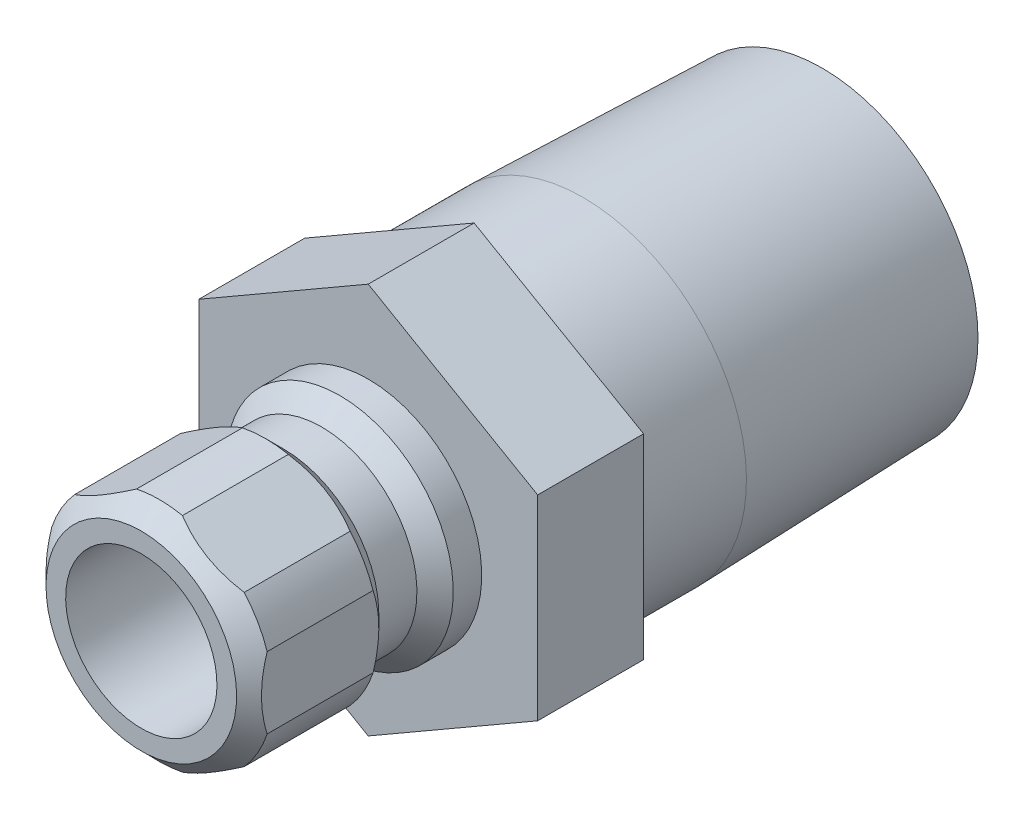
ISO-10303-21;
HEADER;
FILE_DESCRIPTION(('STEP AP214'),'2;1');
FILE_NAME('part.step','',(''),(''),'','','');
FILE_SCHEMA(('AUTOMOTIVE_DESIGN { 1 0 10303 214 1 1 1 1 }'));
ENDSEC;
DATA;
#1=APPLICATION_CONTEXT('core data for automotive mechanical design processes');
#2=APPLICATION_PROTOCOL_DEFINITION('international standard','automotive_design',2000,#1);
#3=PRODUCT_CONTEXT('',#1,'mechanical');
#4=PRODUCT('Part','Part','',(#3));
#5=PRODUCT_RELATED_PRODUCT_CATEGORY('part','',(#4));
#6=PRODUCT_DEFINITION_FORMATION('','',#4);
#7=PRODUCT_DEFINITION_CONTEXT('part definition',#1,'design');
#8=PRODUCT_DEFINITION('design','',#6,#7);
#9=PRODUCT_DEFINITION_SHAPE('','',#8);
#10=(LENGTH_UNIT() NAMED_UNIT(*) SI_UNIT(.MILLI.,.METRE.));
#11=(NAMED_UNIT(*) PLANE_ANGLE_UNIT() SI_UNIT($,.RADIAN.));
#12=(NAMED_UNIT(*) SI_UNIT($,.STERADIAN.) SOLID_ANGLE_UNIT());
#13=UNCERTAINTY_MEASURE_WITH_UNIT(LENGTH_MEASURE(1.E-05),#10,'distance_accuracy_value','');
#14=(GEOMETRIC_REPRESENTATION_CONTEXT(3) GLOBAL_UNCERTAINTY_ASSIGNED_CONTEXT((#13)) GLOBAL_UNIT_ASSIGNED_CONTEXT((#10,
#11,#12)) REPRESENTATION_CONTEXT('',''));
#15=CARTESIAN_POINT('',(0.,0.,0.));
#16=DIRECTION('',(0.,0.,1.));
#17=DIRECTION('',(1.,0.,0.));
#18=AXIS2_PLACEMENT_3D('',#15,#16,#17);
#19=CARTESIAN_POINT('',(0.,0.,0.));
#20=DIRECTION('',(0.,0.,-1.));
#21=DIRECTION('',(0.,1.,0.));
#22=AXIS2_PLACEMENT_3D('',#19,#20,#21);
#23=CYLINDRICAL_SURFACE('',#22,4.7625);
#24=DIRECTION('',(0.,0.,-1.));
#25=VECTOR('',#24,1.);
#26=CARTESIAN_POINT('',(-3.55679350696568,3.16711638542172,0.));
#27=LINE('',#26,#25);
#28=CARTESIAN_POINT('',(-3.55679350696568,3.16711638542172,4.318));
#29=VERTEX_POINT('',#28);
#30=CARTESIAN_POINT('',(-3.55679350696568,3.16711638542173,8.763));
#31=VERTEX_POINT('',#30);
#32=EDGE_CURVE('E52',#29,#31,#27,.F.);
#33=ORIENTED_EDGE('',*,*,#32,.F.);
#34=CARTESIAN_POINT('',(0.,0.,4.318));
#35=DIRECTION('',(0.,0.,-1.));
#36=DIRECTION('',(0.,1.,0.));
#37=AXIS2_PLACEMENT_3D('',#34,#35,#36);
#38=CIRCLE('',#37,4.7625);
#39=CARTESIAN_POINT('',(-4.5212,1.49671534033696,4.318));
#40=VERTEX_POINT('',#39);
#41=EDGE_CURVE('E193',#40,#29,#38,.T.);
#42=ORIENTED_EDGE('',*,*,#41,.F.);
#43=DIRECTION('',(0.,0.,-1.));
#44=VECTOR('',#43,1.);
#45=CARTESIAN_POINT('',(-4.5212,1.49671534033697,0.));
#46=LINE('',#45,#44);
#47=CARTESIAN_POINT('',(-4.5212,1.49671534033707,8.76300000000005));
#48=VERTEX_POINT('',#47);
#49=EDGE_CURVE('E386',#48,#40,#46,.T.);
#50=ORIENTED_EDGE('',*,*,#49,.F.);
#51=CARTESIAN_POINT('',(0.,0.,8.763));
#52=DIRECTION('',(0.,0.,-1.));
#53=DIRECTION('',(0.,1.,0.));
#54=AXIS2_PLACEMENT_3D('',#51,#52,#53);
#55=CIRCLE('',#54,4.7625);
#56=EDGE_CURVE('E198',#48,#31,#55,.T.);
#57=ORIENTED_EDGE('',*,*,#56,.T.);
#58=EDGE_LOOP('',(#33,#42,#50,#57));
#59=FACE_BOUND('',#58,.T.);
#60=ADVANCED_FACE('F33',(#59),#23,.T.);
#61=DIRECTION('',(0.,0.,-1.));
#62=VECTOR('',#61,1.);
#63=CARTESIAN_POINT('',(-4.5212,-1.49671534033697,0.));
#64=LINE('',#63,#62);
#65=CARTESIAN_POINT('',(-4.5212,-1.49671534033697,4.318));
#66=VERTEX_POINT('',#65);
#67=CARTESIAN_POINT('',(-4.5212,-1.49671534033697,8.763));
#68=VERTEX_POINT('',#67);
#69=EDGE_CURVE('E60',#66,#68,#64,.F.);
#70=ORIENTED_EDGE('',*,*,#69,.F.);
#71=CARTESIAN_POINT('',(-3.55679350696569,-3.16711638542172,4.318));
#72=VERTEX_POINT('',#71);
#73=EDGE_CURVE('E443',#72,#66,#38,.T.);
#74=ORIENTED_EDGE('',*,*,#73,.F.);
#75=DIRECTION('',(0.,0.,-1.));
#76=VECTOR('',#75,1.);
#77=CARTESIAN_POINT('',(-3.55679350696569,-3.16711638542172,0.));
#78=LINE('',#77,#76);
#79=CARTESIAN_POINT('',(-3.55679350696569,-3.16711638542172,8.763));
#80=VERTEX_POINT('',#79);
#81=EDGE_CURVE('E381',#80,#72,#78,.T.);
#82=ORIENTED_EDGE('',*,*,#81,.F.);
#83=EDGE_CURVE('E203',#80,#68,#55,.T.);
#84=ORIENTED_EDGE('',*,*,#83,.T.);
#85=EDGE_LOOP('',(#70,#74,#82,#84));
#86=FACE_BOUND('',#85,.T.);
#87=ADVANCED_FACE('F378',(#86),#23,.T.);
#88=DIRECTION('',(0.,0.,-1.));
#89=VECTOR('',#88,1.);
#90=CARTESIAN_POINT('',(-0.964406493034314,-4.66383172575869,0.));
#91=LINE('',#90,#89);
#92=CARTESIAN_POINT('',(-0.964406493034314,-4.66383172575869,4.318));
#93=VERTEX_POINT('',#92);
#94=CARTESIAN_POINT('',(-0.964406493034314,-4.66383172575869,8.763));
#95=VERTEX_POINT('',#94);
#96=EDGE_CURVE('E392',#93,#95,#91,.F.);
#97=ORIENTED_EDGE('',*,*,#96,.F.);
#98=CARTESIAN_POINT('',(0.96440649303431,-4.66383172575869,4.318));
#99=VERTEX_POINT('',#98);
#100=EDGE_CURVE('E441',#99,#93,#38,.T.);
#101=ORIENTED_EDGE('',*,*,#100,.F.);
#102=DIRECTION('',(0.,0.,-1.));
#103=VECTOR('',#102,1.);
#104=CARTESIAN_POINT('',(0.96440649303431,-4.66383172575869,0.));
#105=LINE('',#104,#103);
#106=CARTESIAN_POINT('',(0.96440649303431,-4.66383172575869,8.763));
#107=VERTEX_POINT('',#106);
#108=EDGE_CURVE('E427',#107,#99,#105,.T.);
#109=ORIENTED_EDGE('',*,*,#108,.F.);
#110=EDGE_CURVE('E196',#107,#95,#55,.T.);
#111=ORIENTED_EDGE('',*,*,#110,.T.);
#112=EDGE_LOOP('',(#97,#101,#109,#111));
#113=FACE_BOUND('',#112,.T.);
#114=ADVANCED_FACE('F440',(#113),#23,.T.);
#115=DIRECTION('',(0.,0.,-1.));
#116=VECTOR('',#115,1.);
#117=CARTESIAN_POINT('',(3.55679350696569,-3.16711638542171,0.));
#118=LINE('',#117,#116);
#119=CARTESIAN_POINT('',(3.55679350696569,-3.16711638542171,4.318));
#120=VERTEX_POINT('',#119);
#121=CARTESIAN_POINT('',(3.55679350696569,-3.16711638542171,8.763));
#122=VERTEX_POINT('',#121);
#123=EDGE_CURVE('E429',#120,#122,#118,.F.);
#124=ORIENTED_EDGE('',*,*,#123,.F.);
#125=CARTESIAN_POINT('',(4.5212,-1.49671534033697,4.318));
#126=VERTEX_POINT('',#125);
#127=EDGE_CURVE('E368',#126,#120,#38,.T.);
#128=ORIENTED_EDGE('',*,*,#127,.F.);
#129=DIRECTION('',(0.,0.,-1.));
#130=VECTOR('',#129,1.);
#131=CARTESIAN_POINT('',(4.5212,-1.49671534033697,0.));
#132=LINE('',#131,#130);
#133=CARTESIAN_POINT('',(4.5212,-1.4967153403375,8.76300000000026));
#134=VERTEX_POINT('',#133);
#135=EDGE_CURVE('E360',#134,#126,#132,.T.);
#136=ORIENTED_EDGE('',*,*,#135,.F.);
#137=EDGE_CURVE('E189',#134,#122,#55,.T.);
#138=ORIENTED_EDGE('',*,*,#137,.T.);
#139=EDGE_LOOP('',(#124,#128,#136,#138));
#140=FACE_BOUND('',#139,.T.);
#141=ADVANCED_FACE('F366',(#140),#23,.T.);
#142=DIRECTION('',(0.,0.,-1.));
#143=VECTOR('',#142,1.);
#144=CARTESIAN_POINT('',(4.5212,1.49671534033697,0.));
#145=LINE('',#144,#143);
#146=CARTESIAN_POINT('',(4.5212,1.49671534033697,4.318));
#147=VERTEX_POINT('',#146);
#148=CARTESIAN_POINT('',(4.5212,1.49671534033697,8.763));
#149=VERTEX_POINT('',#148);
#150=EDGE_CURVE('E362',#147,#149,#145,.F.);
#151=ORIENTED_EDGE('',*,*,#150,.F.);
#152=CARTESIAN_POINT('',(3.55679350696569,3.16711638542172,4.318));
#153=VERTEX_POINT('',#152);
#154=EDGE_CURVE('E182',#153,#147,#38,.T.);
#155=ORIENTED_EDGE('',*,*,#154,.F.);
#156=DIRECTION('',(0.,0.,-1.));
#157=VECTOR('',#156,1.);
#158=CARTESIAN_POINT('',(3.55679350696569,3.16711638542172,0.));
#159=LINE('',#158,#157);
#160=CARTESIAN_POINT('',(3.55679350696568,3.16711638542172,8.763));
#161=VERTEX_POINT('',#160);
#162=EDGE_CURVE('E164',#161,#153,#159,.T.);
#163=ORIENTED_EDGE('',*,*,#162,.F.);
#164=EDGE_CURVE('E180',#161,#149,#55,.T.);
#165=ORIENTED_EDGE('',*,*,#164,.T.);
#166=EDGE_LOOP('',(#151,#155,#163,#165));
#167=FACE_BOUND('',#166,.T.);
#168=ADVANCED_FACE('F179',(#167),#23,.T.);
#169=CARTESIAN_POINT('',(0.,0.,0.));
#170=DIRECTION('',(0.,0.,-1.));
#171=DIRECTION('',(0.,1.,0.));
#172=AXIS2_PLACEMENT_3D('',#169,#170,#171);
#173=CYLINDRICAL_SURFACE('',#172,3.175);
#174=CARTESIAN_POINT('',(0.,0.,9.525));
#175=DIRECTION('',(0.,0.,-1.));
#176=DIRECTION('',(0.,1.,0.));
#177=AXIS2_PLACEMENT_3D('',#174,#175,#176);
#178=CIRCLE('',#177,3.175);
#179=CARTESIAN_POINT('',(0.,3.175,9.525));
#180=VERTEX_POINT('',#179);
#181=EDGE_CURVE('E205',#180,#180,#178,.T.);
#182=ORIENTED_EDGE('',*,*,#181,.F.);
#183=EDGE_LOOP('',(#182));
#184=FACE_BOUND('',#183,.T.);
#185=CARTESIAN_POINT('',(0.,0.,-4.445));
#186=DIRECTION('',(0.,0.,1.));
#187=DIRECTION('',(1.,0.,0.));
#188=AXIS2_PLACEMENT_3D('',#185,#186,#187);
#189=CIRCLE('',#188,3.175);
#190=CARTESIAN_POINT('',(3.175,0.,-4.445));
#191=VERTEX_POINT('',#190);
#192=EDGE_CURVE('E246',#191,#191,#189,.T.);
#193=ORIENTED_EDGE('',*,*,#192,.F.);
#194=EDGE_LOOP('',(#193));
#195=FACE_BOUND('',#194,.T.);
#196=ADVANCED_FACE('F35',(#184,#195),#173,.F.);
#197=CARTESIAN_POINT('',(0.,4.7625,0.));
#198=DIRECTION('',(0.,0.,1.));
#199=DIRECTION('',(0.,-1.,0.));
#200=AXIS2_PLACEMENT_3D('',#197,#198,#199);
#201=PLANE('',#200);
#202=CARTESIAN_POINT('',(0.,0.,0.));
#203=DIRECTION('',(0.,0.,-1.));
#204=DIRECTION('',(0.,1.,0.));
#205=AXIS2_PLACEMENT_3D('',#202,#203,#204);
#206=CIRCLE('',#205,4.7625);
#207=CARTESIAN_POINT('',(0.,4.7625,0.));
#208=VERTEX_POINT('',#207);
#209=EDGE_CURVE('E454',#208,#208,#206,.T.);
#210=ORIENTED_EDGE('',*,*,#209,.T.);
#211=EDGE_LOOP('',(#210));
#212=FACE_BOUND('',#211,.T.);
#213=DIRECTION('',(-0.866025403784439,-0.5,0.));
#214=VECTOR('',#213,1.);
#215=CARTESIAN_POINT('',(0.,8.21223022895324,0.));
#216=LINE('',#215,#214);
#217=CARTESIAN_POINT('',(0.,8.21223022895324,0.));
#218=VERTEX_POINT('',#217);
#219=CARTESIAN_POINT('',(-7.112,4.10611511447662,0.));
#220=VERTEX_POINT('',#219);
#221=EDGE_CURVE('E243',#218,#220,#216,.T.);
#222=ORIENTED_EDGE('',*,*,#221,.T.);
#223=DIRECTION('',(0.,-1.,0.));
#224=VECTOR('',#223,1.);
#225=CARTESIAN_POINT('',(-7.112,4.10611511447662,0.));
#226=LINE('',#225,#224);
#227=CARTESIAN_POINT('',(-7.112,-4.10611511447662,0.));
#228=VERTEX_POINT('',#227);
#229=EDGE_CURVE('E240',#220,#228,#226,.T.);
#230=ORIENTED_EDGE('',*,*,#229,.T.);
#231=DIRECTION('',(0.866025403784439,-0.5,0.));
#232=VECTOR('',#231,1.);
#233=CARTESIAN_POINT('',(-7.112,-4.10611511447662,0.));
#234=LINE('',#233,#232);
#235=CARTESIAN_POINT('',(0.,-8.21223022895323,0.));
#236=VERTEX_POINT('',#235);
#237=EDGE_CURVE('E237',#228,#236,#234,.T.);
#238=ORIENTED_EDGE('',*,*,#237,.T.);
#239=DIRECTION('',(0.866025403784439,0.5,0.));
#240=VECTOR('',#239,1.);
#241=CARTESIAN_POINT('',(0.,-8.21223022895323,0.));
#242=LINE('',#241,#240);
#243=CARTESIAN_POINT('',(7.112,-4.10611511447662,0.));
#244=VERTEX_POINT('',#243);
#245=EDGE_CURVE('E234',#236,#244,#242,.T.);
#246=ORIENTED_EDGE('',*,*,#245,.T.);
#247=DIRECTION('',(0.,1.,0.));
#248=VECTOR('',#247,1.);
#249=CARTESIAN_POINT('',(7.112,-4.10611511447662,0.));
#250=LINE('',#249,#248);
#251=CARTESIAN_POINT('',(7.112,4.10611511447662,0.));
#252=VERTEX_POINT('',#251);
#253=EDGE_CURVE('E231',#244,#252,#250,.T.);
#254=ORIENTED_EDGE('',*,*,#253,.T.);
#255=DIRECTION('',(-0.866025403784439,0.5,0.));
#256=VECTOR('',#255,1.);
#257=CARTESIAN_POINT('',(7.112,4.10611511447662,0.));
#258=LINE('',#257,#256);
#259=EDGE_CURVE('E227',#252,#218,#258,.T.);
#260=ORIENTED_EDGE('',*,*,#259,.T.);
#261=EDGE_LOOP('',(#222,#230,#238,#246,#254,#260));
#262=FACE_BOUND('',#261,.T.);
#263=ADVANCED_FACE('F482',(#212,#262),#201,.T.);
#264=CARTESIAN_POINT('',(0.,0.,0.));
#265=DIRECTION('',(0.,0.,-1.));
#266=DIRECTION('',(0.,1.,0.));
#267=AXIS2_PLACEMENT_3D('',#264,#265,#266);
#268=CYLINDRICAL_SURFACE('',#267,4.7625);
#269=CARTESIAN_POINT('',(0.,0.,1.1938));
#270=DIRECTION('',(0.,0.,-1.));
#271=DIRECTION('',(0.,1.,0.));
#272=AXIS2_PLACEMENT_3D('',#269,#270,#271);
#273=CIRCLE('',#272,4.7625);
#274=CARTESIAN_POINT('',(0.,4.7625,1.1938));
#275=VERTEX_POINT('',#274);
#276=EDGE_CURVE('E451',#275,#275,#273,.T.);
#277=ORIENTED_EDGE('',*,*,#276,.T.);
#278=EDGE_LOOP('',(#277));
#279=FACE_BOUND('',#278,.T.);
#280=ORIENTED_EDGE('',*,*,#209,.F.);
#281=EDGE_LOOP('',(#280));
#282=FACE_BOUND('',#281,.T.);
#283=ADVANCED_FACE('F484',(#279,#282),#268,.T.);
#284=CARTESIAN_POINT('',(0.,0.,1.1938));
#285=DIRECTION('',(0.,0.,-1.));
#286=DIRECTION('',(0.,1.,0.));
#287=AXIS2_PLACEMENT_3D('',#284,#285,#286);
#288=CONICAL_SURFACE('',#287,4.7625,0.785398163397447);
#289=CARTESIAN_POINT('',(0.,0.,1.9558));
#290=DIRECTION('',(0.,0.,-1.));
#291=DIRECTION('',(0.,1.,0.));
#292=AXIS2_PLACEMENT_3D('',#289,#290,#291);
#293=CIRCLE('',#292,4.0005);
#294=CARTESIAN_POINT('',(0.,4.0005,1.9558));
#295=VERTEX_POINT('',#294);
#296=EDGE_CURVE('E448',#295,#295,#293,.T.);
#297=ORIENTED_EDGE('',*,*,#296,.T.);
#298=EDGE_LOOP('',(#297));
#299=FACE_BOUND('',#298,.T.);
#300=ORIENTED_EDGE('',*,*,#276,.F.);
#301=EDGE_LOOP('',(#300));
#302=FACE_BOUND('',#301,.T.);
#303=ADVANCED_FACE('F491',(#299,#302),#288,.T.);
#304=CARTESIAN_POINT('',(0.,0.,0.));
#305=DIRECTION('',(0.,0.,-1.));
#306=DIRECTION('',(0.,1.,0.));
#307=AXIS2_PLACEMENT_3D('',#304,#305,#306);
#308=CYLINDRICAL_SURFACE('',#307,4.0005);
#309=CARTESIAN_POINT('',(0.,0.,3.556));
#310=DIRECTION('',(0.,0.,-1.));
#311=DIRECTION('',(0.,1.,0.));
#312=AXIS2_PLACEMENT_3D('',#309,#310,#311);
#313=CIRCLE('',#312,4.0005);
#314=CARTESIAN_POINT('',(0.,4.0005,3.556));
#315=VERTEX_POINT('',#314);
#316=EDGE_CURVE('E445',#315,#315,#313,.T.);
#317=ORIENTED_EDGE('',*,*,#316,.T.);
#318=EDGE_LOOP('',(#317));
#319=FACE_BOUND('',#318,.T.);
#320=ORIENTED_EDGE('',*,*,#296,.F.);
#321=EDGE_LOOP('',(#320));
#322=FACE_BOUND('',#321,.T.);
#323=ADVANCED_FACE('F505',(#319,#322),#308,.T.);
#324=CARTESIAN_POINT('',(0.,0.,3.556));
#325=DIRECTION('',(0.,0.,1.));
#326=DIRECTION('',(0.,-1.,0.));
#327=AXIS2_PLACEMENT_3D('',#324,#325,#326);
#328=CONICAL_SURFACE('',#327,4.0005,0.785398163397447);
#329=CARTESIAN_POINT('',(-0.963855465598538,4.66414986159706,4.31820000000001));
#330=CARTESIAN_POINT('',(-1.06211459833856,4.60741992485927,4.28250453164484));
#331=CARTESIAN_POINT('',(-1.16133744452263,4.55013358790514,4.25015975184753));
#332=CARTESIAN_POINT('',(-1.36150734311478,4.4345654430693,4.19301912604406));
#333=CARTESIAN_POINT('',(-1.46245615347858,4.37628262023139,4.16823152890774));
#334=CARTESIAN_POINT('',(-1.66329527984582,4.26032809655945,4.12761249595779));
#335=CARTESIAN_POINT('',(-1.76315556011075,4.20267373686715,4.11158606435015));
#336=CARTESIAN_POINT('',(-1.96359010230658,4.08695279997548,4.0882280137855));
#337=CARTESIAN_POINT('',(-2.06416398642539,4.02888644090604,4.08089209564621));
#338=CARTESIAN_POINT('',(-2.28105319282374,3.90366539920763,4.07477347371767));
#339=CARTESIAN_POINT('',(-2.39740267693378,3.83649099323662,4.07748535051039));
#340=CARTESIAN_POINT('',(-2.62951932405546,3.70247838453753,4.09475099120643));
#341=CARTESIAN_POINT('',(-2.74528596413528,3.63564048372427,4.10931395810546));
#342=CARTESIAN_POINT('',(-2.97849221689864,3.50099879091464,4.15008725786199));
#343=CARTESIAN_POINT('',(-3.09589051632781,3.4332188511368,4.17660635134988));
#344=CARTESIAN_POINT('',(-3.32841299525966,3.29897193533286,4.23998706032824));
#345=CARTESIAN_POINT('',(-3.44354014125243,3.2325032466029,4.27683407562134));
#346=CARTESIAN_POINT('',(-3.55734453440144,3.16679824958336,4.3182));
#347=B_SPLINE_CURVE_WITH_KNOTS('',3,(#329,#330,#331,#332,#333,#334,#335,#336,#337,#338,#339,
#340,#341,#342,#343,#344,#345,#346),.UNSPECIFIED.,.F.,.F.,(4,2,2,2,2,2,2,2,4),(0.,
0.356859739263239,0.71410761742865,1.06304196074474,1.41180361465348,1.81438443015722,
2.21727816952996,2.6312318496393,3.04460326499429),.UNSPECIFIED.);
#348=CARTESIAN_POINT('',(-0.964406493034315,4.66383172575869,4.318));
#349=VERTEX_POINT('',#348);
#350=EDGE_CURVE('E265',#349,#29,#347,.T.);
#351=ORIENTED_EDGE('',*,*,#350,.F.);
#352=CARTESIAN_POINT('',(0.964406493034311,4.66383172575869,4.318));
#353=VERTEX_POINT('',#352);
#354=EDGE_CURVE('E188',#349,#353,#38,.T.);
#355=ORIENTED_EDGE('',*,*,#354,.T.);
#356=CARTESIAN_POINT('',(3.55734453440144,3.16679824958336,4.3182));
#357=CARTESIAN_POINT('',(3.45908540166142,3.22352818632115,4.28250453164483));
#358=CARTESIAN_POINT('',(3.35986255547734,3.28081452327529,4.25015975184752));
#359=CARTESIAN_POINT('',(3.15969265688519,3.39638266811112,4.19301912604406));
#360=CARTESIAN_POINT('',(3.0587438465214,3.45466549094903,4.16823152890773));
#361=CARTESIAN_POINT('',(2.85790472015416,3.57062001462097,4.12761249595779));
#362=CARTESIAN_POINT('',(2.75804443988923,3.62827437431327,4.11158606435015));
#363=CARTESIAN_POINT('',(2.55760989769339,3.74399531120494,4.0882280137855));
#364=CARTESIAN_POINT('',(2.45703601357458,3.80206167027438,4.0808920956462));
#365=CARTESIAN_POINT('',(2.24014680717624,3.92728271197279,4.07477347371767));
#366=CARTESIAN_POINT('',(2.1237973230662,3.9944571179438,4.07748535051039));
#367=CARTESIAN_POINT('',(1.89168067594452,4.12846972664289,4.09475099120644));
#368=CARTESIAN_POINT('',(1.77591403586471,4.19530762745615,4.10931395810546));
#369=CARTESIAN_POINT('',(1.54270778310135,4.32994932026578,4.15008725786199));
#370=CARTESIAN_POINT('',(1.42530948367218,4.39772926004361,4.17660635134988));
#371=CARTESIAN_POINT('',(1.19278700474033,4.53197617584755,4.23998706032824));
#372=CARTESIAN_POINT('',(1.07765985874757,4.59844486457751,4.27683407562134));
#373=CARTESIAN_POINT('',(0.963855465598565,4.66414986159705,4.3182));
#374=B_SPLINE_CURVE_WITH_KNOTS('',3,(#356,#357,#358,#359,#360,#361,#362,#363,#364,#365,#366,
#367,#368,#369,#370,#371,#372,#373),.UNSPECIFIED.,.F.,.F.,(4,2,2,2,2,2,2,2,4),(0.,
0.356859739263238,0.714107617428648,1.06304196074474,1.41180361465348,1.81438443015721,
2.21727816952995,2.63123184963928,3.04460326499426),.UNSPECIFIED.);
#375=EDGE_CURVE('E369',#153,#353,#374,.T.);
#376=ORIENTED_EDGE('',*,*,#375,.F.);
#377=ORIENTED_EDGE('',*,*,#154,.T.);
#378=CARTESIAN_POINT('',(4.5212,-5.0602333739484,6.34130954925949));
#379=CARTESIAN_POINT('',(4.5212,-4.93634312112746,6.24894471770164));
#380=CARTESIAN_POINT('',(4.5212,-4.811743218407,6.15751593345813));
#381=CARTESIAN_POINT('',(4.5212,-4.56085059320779,5.97694414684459));
#382=CARTESIAN_POINT('',(4.5212,-4.43455743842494,5.88780174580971));
#383=CARTESIAN_POINT('',(4.5212,-4.17908222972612,5.71158429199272));
#384=CARTESIAN_POINT('',(4.5212,-4.04988536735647,5.62453063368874));
#385=CARTESIAN_POINT('',(4.5212,-3.78927482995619,5.45381787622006));
#386=CARTESIAN_POINT('',(4.5212,-3.65786131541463,5.37015853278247));
#387=CARTESIAN_POINT('',(4.5212,-3.38538701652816,5.20261763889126));
#388=CARTESIAN_POINT('',(4.5212,-3.24418594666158,5.1189630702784));
#389=CARTESIAN_POINT('',(4.5212,-2.95850534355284,4.95736305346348));
#390=CARTESIAN_POINT('',(4.5212,-2.81402531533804,4.87941847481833));
#391=CARTESIAN_POINT('',(4.5212,-2.52183304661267,4.73093303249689));
#392=CARTESIAN_POINT('',(4.5212,-2.37413195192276,4.66037040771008));
#393=CARTESIAN_POINT('',(4.5212,-2.07479760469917,4.52822712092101));
#394=CARTESIAN_POINT('',(4.5212,-1.92316611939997,4.46664250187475));
#395=CARTESIAN_POINT('',(4.5212,-1.62629805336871,4.35845014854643));
#396=CARTESIAN_POINT('',(4.5212,-1.48133250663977,4.31110656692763));
#397=CARTESIAN_POINT('',(4.5212,-1.18803884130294,4.22807147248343));
#398=CARTESIAN_POINT('',(4.5212,-1.03971047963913,4.19238080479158));
#399=CARTESIAN_POINT('',(4.5212,-0.742975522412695,4.13506970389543));
#400=CARTESIAN_POINT('',(4.5212,-0.594614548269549,4.11321684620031));
#401=CARTESIAN_POINT('',(4.5212,-0.296466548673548,4.08398275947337));
#402=CARTESIAN_POINT('',(4.5212,-0.146679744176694,4.07659932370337));
#403=CARTESIAN_POINT('',(4.5212,0.148070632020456,4.07679953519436));
#404=CARTESIAN_POINT('',(4.5212,0.293034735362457,4.08391049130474));
#405=CARTESIAN_POINT('',(4.5212,0.581648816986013,4.11169566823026));
#406=CARTESIAN_POINT('',(4.5212,0.72529866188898,4.13237125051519));
#407=CARTESIAN_POINT('',(4.5212,1.0126713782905,4.18653465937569));
#408=CARTESIAN_POINT('',(4.5212,1.15635345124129,4.22023563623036));
#409=CARTESIAN_POINT('',(4.5212,1.44060339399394,4.29869626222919));
#410=CARTESIAN_POINT('',(4.5212,1.58117157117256,4.34345481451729));
#411=CARTESIAN_POINT('',(4.5212,1.8753823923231,4.44806815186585));
#412=CARTESIAN_POINT('',(4.5212,2.02860927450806,4.5090813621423));
#413=CARTESIAN_POINT('',(4.5212,2.3310511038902,4.64042631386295));
#414=CARTESIAN_POINT('',(4.5212,2.48026409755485,4.71076249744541));
#415=CARTESIAN_POINT('',(4.5212,2.77542641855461,4.85907493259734));
#416=CARTESIAN_POINT('',(4.5212,2.92136343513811,4.93707548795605));
#417=CARTESIAN_POINT('',(4.5212,3.20986770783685,5.09898712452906));
#418=CARTESIAN_POINT('',(4.5212,3.35243550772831,5.18289724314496));
#419=CARTESIAN_POINT('',(4.5212,3.62758150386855,5.35113227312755));
#420=CARTESIAN_POINT('',(4.5212,3.76030215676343,5.43522542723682));
#421=CARTESIAN_POINT('',(4.5212,4.02346673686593,5.60691265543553));
#422=CARTESIAN_POINT('',(4.5212,4.1539104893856,5.69450699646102));
#423=CARTESIAN_POINT('',(4.5212,4.41175524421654,5.87183831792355));
#424=CARTESIAN_POINT('',(4.5212,4.5391724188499,5.96155186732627));
#425=CARTESIAN_POINT('',(4.5212,4.79227118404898,6.14332505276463));
#426=CARTESIAN_POINT('',(4.5212,4.91795324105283,6.23538403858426));
#427=CARTESIAN_POINT('',(4.5212,5.04290975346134,6.32840101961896));
#428=B_SPLINE_CURVE_WITH_KNOTS('',3,(#378,#379,#380,#381,#382,#383,#384,#385,#386,#387,#388,
#389,#390,#391,#392,#393,#394,#395,#396,#397,#398,#399,#400,#401,#402,#403,#404,#405,#406,#407,
#408,#409,#410,#411,#412,#413,#414,#415,#416,#417,#418,#419,#420,#421,#422,#423,#424,#425,#426,
#427),.UNSPECIFIED.,.F.,.F.,(4,2,2,2,2,2,2,2,2,2,2,2,2,2,2,2,2,2,2,2,2,2,2,2,4),(0.,
0.463604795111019,0.927330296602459,1.39465214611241,1.86194030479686,2.35419709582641,
2.84652869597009,3.33736544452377,3.82798519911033,4.28507980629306,4.74220755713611,
5.19143799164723,5.64059990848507,6.07534819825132,6.51014013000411,6.9523708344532,
7.39455768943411,7.88895068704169,8.38358010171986,8.8798319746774,9.37600320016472,
9.8472959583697,10.3186247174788,10.7860923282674,11.2534317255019),.UNSPECIFIED.);
#429=EDGE_CURVE('E422',#126,#147,#428,.T.);
#430=ORIENTED_EDGE('',*,*,#429,.F.);
#431=ORIENTED_EDGE('',*,*,#127,.T.);
#432=CARTESIAN_POINT('',(0.963855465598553,-4.66414986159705,4.3182));
#433=CARTESIAN_POINT('',(1.06211459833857,-4.60741992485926,4.28250453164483));
#434=CARTESIAN_POINT('',(1.16133744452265,-4.55013358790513,4.25015975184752));
#435=CARTESIAN_POINT('',(1.36150734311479,-4.43456544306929,4.19301912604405));
#436=CARTESIAN_POINT('',(1.46245615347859,-4.37628262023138,4.16823152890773));
#437=CARTESIAN_POINT('',(1.66329527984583,-4.26032809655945,4.12761249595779));
#438=CARTESIAN_POINT('',(1.76315556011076,-4.20267373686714,4.11158606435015));
#439=CARTESIAN_POINT('',(1.96359010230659,-4.08695279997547,4.08822801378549));
#440=CARTESIAN_POINT('',(2.0641639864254,-4.02888644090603,4.0808920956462));
#441=CARTESIAN_POINT('',(2.28105319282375,-3.90366539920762,4.07477347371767));
#442=CARTESIAN_POINT('',(2.39740267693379,-3.83649099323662,4.07748535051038));
#443=CARTESIAN_POINT('',(2.62951932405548,-3.70247838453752,4.09475099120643));
#444=CARTESIAN_POINT('',(2.74528596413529,-3.63564048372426,4.10931395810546));
#445=CARTESIAN_POINT('',(2.97849221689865,-3.50099879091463,4.15008725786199));
#446=CARTESIAN_POINT('',(3.09589051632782,-3.43321885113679,4.17660635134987));
#447=CARTESIAN_POINT('',(3.32841299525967,-3.29897193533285,4.23998706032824));
#448=CARTESIAN_POINT('',(3.44354014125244,-3.23250324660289,4.27683407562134));
#449=CARTESIAN_POINT('',(3.55734453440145,-3.16679824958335,4.3182));
#450=B_SPLINE_CURVE_WITH_KNOTS('',3,(#432,#433,#434,#435,#436,#437,#438,#439,#440,#441,#442,
#443,#444,#445,#446,#447,#448,#449),.UNSPECIFIED.,.F.,.F.,(4,2,2,2,2,2,2,2,4),(0.,
0.356859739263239,0.714107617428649,1.06304196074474,1.41180361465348,1.81438443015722,
2.21727816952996,2.6312318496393,3.04460326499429),.UNSPECIFIED.);
#451=EDGE_CURVE('E431',#99,#120,#450,.T.);
#452=ORIENTED_EDGE('',*,*,#451,.F.);
#453=ORIENTED_EDGE('',*,*,#100,.T.);
#454=CARTESIAN_POINT('',(-3.55734453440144,-3.16679824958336,4.3182));
#455=CARTESIAN_POINT('',(-3.45908540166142,-3.22352818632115,4.28250453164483));
#456=CARTESIAN_POINT('',(-3.35986255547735,-3.28081452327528,4.25015975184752));
#457=CARTESIAN_POINT('',(-3.1596926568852,-3.39638266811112,4.19301912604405));
#458=CARTESIAN_POINT('',(-3.0587438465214,-3.45466549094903,4.16823152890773));
#459=CARTESIAN_POINT('',(-2.85790472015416,-3.57062001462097,4.12761249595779));
#460=CARTESIAN_POINT('',(-2.75804443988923,-3.62827437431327,4.11158606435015));
#461=CARTESIAN_POINT('',(-2.5576098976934,-3.74399531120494,4.0882280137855));
#462=CARTESIAN_POINT('',(-2.45703601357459,-3.80206167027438,4.0808920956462));
#463=CARTESIAN_POINT('',(-2.24014680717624,-3.92728271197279,4.07477347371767));
#464=CARTESIAN_POINT('',(-2.1237973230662,-3.9944571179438,4.07748535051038));
#465=CARTESIAN_POINT('',(-1.89168067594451,-4.12846972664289,4.09475099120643));
#466=CARTESIAN_POINT('',(-1.7759140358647,-4.19530762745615,4.10931395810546));
#467=CARTESIAN_POINT('',(-1.54270778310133,-4.32994932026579,4.15008725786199));
#468=CARTESIAN_POINT('',(-1.42530948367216,-4.39772926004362,4.17660635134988));
#469=CARTESIAN_POINT('',(-1.19278700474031,-4.53197617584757,4.23998706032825));
#470=CARTESIAN_POINT('',(-1.07765985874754,-4.59844486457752,4.27683407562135));
#471=CARTESIAN_POINT('',(-0.963855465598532,-4.66414986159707,4.31820000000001));
#472=B_SPLINE_CURVE_WITH_KNOTS('',3,(#454,#455,#456,#457,#458,#459,#460,#461,#462,#463,#464,
#465,#466,#467,#468,#469,#470,#471),.UNSPECIFIED.,.F.,.F.,(4,2,2,2,2,2,2,2,4),(0.,
0.356859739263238,0.714107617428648,1.06304196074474,1.41180361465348,1.81438443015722,
2.21727816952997,2.63123184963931,3.04460326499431),.UNSPECIFIED.);
#473=EDGE_CURVE('E388',#72,#93,#472,.T.);
#474=ORIENTED_EDGE('',*,*,#473,.F.);
#475=ORIENTED_EDGE('',*,*,#73,.T.);
#476=CARTESIAN_POINT('',(-4.5212,-5.0602333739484,6.34130954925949));
#477=CARTESIAN_POINT('',(-4.5212,-4.93634312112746,6.24894471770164));
#478=CARTESIAN_POINT('',(-4.5212,-4.81174321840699,6.15751593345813));
#479=CARTESIAN_POINT('',(-4.5212,-4.56085059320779,5.97694414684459));
#480=CARTESIAN_POINT('',(-4.5212,-4.43455743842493,5.88780174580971));
#481=CARTESIAN_POINT('',(-4.5212,-4.17908222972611,5.71158429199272));
#482=CARTESIAN_POINT('',(-4.5212,-4.04988536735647,5.62453063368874));
#483=CARTESIAN_POINT('',(-4.5212,-3.78927482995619,5.45381787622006));
#484=CARTESIAN_POINT('',(-4.5212,-3.65786131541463,5.37015853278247));
#485=CARTESIAN_POINT('',(-4.5212,-3.38538701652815,5.20261763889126));
#486=CARTESIAN_POINT('',(-4.5212,-3.24418594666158,5.11896307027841));
#487=CARTESIAN_POINT('',(-4.5212,-2.95850534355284,4.95736305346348));
#488=CARTESIAN_POINT('',(-4.5212,-2.81402531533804,4.87941847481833));
#489=CARTESIAN_POINT('',(-4.5212,-2.52183304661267,4.73093303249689));
#490=CARTESIAN_POINT('',(-4.5212,-2.37413195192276,4.66037040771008));
#491=CARTESIAN_POINT('',(-4.5212,-2.07479760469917,4.52822712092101));
#492=CARTESIAN_POINT('',(-4.5212,-1.92316611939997,4.46664250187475));
#493=CARTESIAN_POINT('',(-4.5212,-1.62629805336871,4.35845014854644));
#494=CARTESIAN_POINT('',(-4.5212,-1.48133250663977,4.31110656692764));
#495=CARTESIAN_POINT('',(-4.5212,-1.18803884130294,4.22807147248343));
#496=CARTESIAN_POINT('',(-4.5212,-1.03971047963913,4.19238080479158));
#497=CARTESIAN_POINT('',(-4.5212,-0.742975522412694,4.13506970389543));
#498=CARTESIAN_POINT('',(-4.5212,-0.594614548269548,4.11321684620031));
#499=CARTESIAN_POINT('',(-4.5212,-0.296466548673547,4.08398275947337));
#500=CARTESIAN_POINT('',(-4.5212,-0.146679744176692,4.07659932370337));
#501=CARTESIAN_POINT('',(-4.5212,0.148070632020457,4.07679953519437));
#502=CARTESIAN_POINT('',(-4.5212,0.293034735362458,4.08391049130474));
#503=CARTESIAN_POINT('',(-4.5212,0.581648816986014,4.11169566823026));
#504=CARTESIAN_POINT('',(-4.5212,0.725298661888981,4.13237125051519));
#505=CARTESIAN_POINT('',(-4.5212,1.0126713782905,4.18653465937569));
#506=CARTESIAN_POINT('',(-4.5212,1.15635345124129,4.22023563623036));
#507=CARTESIAN_POINT('',(-4.5212,1.44060339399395,4.29869626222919));
#508=CARTESIAN_POINT('',(-4.5212,1.58117157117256,4.3434548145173));
#509=CARTESIAN_POINT('',(-4.5212,1.8753823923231,4.44806815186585));
#510=CARTESIAN_POINT('',(-4.5212,2.02860927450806,4.50908136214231));
#511=CARTESIAN_POINT('',(-4.5212,2.3310511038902,4.64042631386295));
#512=CARTESIAN_POINT('',(-4.5212,2.48026409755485,4.71076249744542));
#513=CARTESIAN_POINT('',(-4.5212,2.77542641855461,4.85907493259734));
#514=CARTESIAN_POINT('',(-4.5212,2.92136343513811,4.93707548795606));
#515=CARTESIAN_POINT('',(-4.5212,3.20986770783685,5.09898712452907));
#516=CARTESIAN_POINT('',(-4.5212,3.35243550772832,5.18289724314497));
#517=CARTESIAN_POINT('',(-4.5212,3.62758150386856,5.35113227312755));
#518=CARTESIAN_POINT('',(-4.5212,3.76030215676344,5.43522542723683));
#519=CARTESIAN_POINT('',(-4.5212,4.02346673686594,5.60691265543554));
#520=CARTESIAN_POINT('',(-4.5212,4.1539104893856,5.69450699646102));
#521=CARTESIAN_POINT('',(-4.5212,4.41175524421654,5.87183831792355));
#522=CARTESIAN_POINT('',(-4.5212,4.53917241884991,5.96155186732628));
#523=CARTESIAN_POINT('',(-4.5212,4.79227118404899,6.14332505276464));
#524=CARTESIAN_POINT('',(-4.5212,4.91795324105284,6.23538403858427));
#525=CARTESIAN_POINT('',(-4.5212,5.04290975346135,6.32840101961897));
#526=B_SPLINE_CURVE_WITH_KNOTS('',3,(#476,#477,#478,#479,#480,#481,#482,#483,#484,#485,#486,
#487,#488,#489,#490,#491,#492,#493,#494,#495,#496,#497,#498,#499,#500,#501,#502,#503,#504,#505,
#506,#507,#508,#509,#510,#511,#512,#513,#514,#515,#516,#517,#518,#519,#520,#521,#522,#523,#524,
#525),.UNSPECIFIED.,.F.,.F.,(4,2,2,2,2,2,2,2,2,2,2,2,2,2,2,2,2,2,2,2,2,2,2,2,4),(0.,
0.463604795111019,0.92733029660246,1.39465214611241,1.86194030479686,2.35419709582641,
2.84652869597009,3.33736544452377,3.82798519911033,4.28507980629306,4.74220755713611,
5.19143799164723,5.64059990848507,6.07534819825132,6.51014013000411,6.9523708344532,
7.39455768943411,7.88895068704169,8.38358010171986,8.87983197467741,9.37600320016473,
9.84729595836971,10.3186247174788,10.7860923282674,11.253431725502),.UNSPECIFIED.);
#527=EDGE_CURVE('E390',#40,#66,#526,.F.);
#528=ORIENTED_EDGE('',*,*,#527,.F.);
#529=ORIENTED_EDGE('',*,*,#41,.T.);
#530=EDGE_LOOP('',(#351,#355,#376,#377,#430,#431,#452,#453,#474,#475,#528,#529));
#531=FACE_BOUND('',#530,.T.);
#532=ORIENTED_EDGE('',*,*,#316,.F.);
#533=EDGE_LOOP('',(#532));
#534=FACE_BOUND('',#533,.T.);
#535=ADVANCED_FACE('F272',(#531,#534),#328,.T.);
#536=DIRECTION('',(0.,0.,-1.));
#537=VECTOR('',#536,1.);
#538=CARTESIAN_POINT('',(-0.964406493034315,4.66383172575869,0.));
#539=LINE('',#538,#537);
#540=CARTESIAN_POINT('',(-0.964406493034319,4.66383172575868,8.763));
#541=VERTEX_POINT('',#540);
#542=EDGE_CURVE('E402',#541,#349,#539,.T.);
#543=ORIENTED_EDGE('',*,*,#542,.F.);
#544=CARTESIAN_POINT('',(0.964406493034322,4.66383172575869,8.763));
#545=VERTEX_POINT('',#544);
#546=EDGE_CURVE('E191',#541,#545,#55,.T.);
#547=ORIENTED_EDGE('',*,*,#546,.T.);
#548=DIRECTION('',(0.,0.,-1.));
#549=VECTOR('',#548,1.);
#550=CARTESIAN_POINT('',(0.964406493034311,4.66383172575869,0.));
#551=LINE('',#550,#549);
#552=EDGE_CURVE('E167',#353,#545,#551,.F.);
#553=ORIENTED_EDGE('',*,*,#552,.F.);
#554=ORIENTED_EDGE('',*,*,#354,.F.);
#555=EDGE_LOOP('',(#543,#547,#553,#554));
#556=FACE_BOUND('',#555,.T.);
#557=ADVANCED_FACE('F320',(#556),#23,.T.);
#558=CARTESIAN_POINT('',(0.,0.,8.763));
#559=DIRECTION('',(0.,0.,-1.));
#560=DIRECTION('',(0.,1.,0.));
#561=AXIS2_PLACEMENT_3D('',#558,#559,#560);
#562=CONICAL_SURFACE('',#561,4.7625,0.785398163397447);
#563=CARTESIAN_POINT('',(-3.55734453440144,3.16679824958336,8.7628));
#564=CARTESIAN_POINT('',(-3.45908540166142,3.22352818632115,8.79849546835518));
#565=CARTESIAN_POINT('',(-3.35986255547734,3.28081452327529,8.83084024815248));
#566=CARTESIAN_POINT('',(-3.15969265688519,3.39638266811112,8.88798087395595));
#567=CARTESIAN_POINT('',(-3.05874384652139,3.45466549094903,8.91276847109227));
#568=CARTESIAN_POINT('',(-2.85790472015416,3.57062001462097,8.95338750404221));
#569=CARTESIAN_POINT('',(-2.75804443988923,3.62827437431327,8.96941393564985));
#570=CARTESIAN_POINT('',(-2.55760989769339,3.74399531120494,8.9927719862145));
#571=CARTESIAN_POINT('',(-2.45703601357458,3.80206167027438,9.0001079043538));
#572=CARTESIAN_POINT('',(-2.24014680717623,3.92728271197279,9.00622652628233));
#573=CARTESIAN_POINT('',(-2.12379732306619,3.9944571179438,9.00351464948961));
#574=CARTESIAN_POINT('',(-1.89168067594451,4.1284697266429,8.98624900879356));
#575=CARTESIAN_POINT('',(-1.77591403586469,4.19530762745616,8.97168604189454));
#576=CARTESIAN_POINT('',(-1.54270778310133,4.32994932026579,8.93091274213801));
#577=CARTESIAN_POINT('',(-1.42530948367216,4.39772926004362,8.90439364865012));
#578=CARTESIAN_POINT('',(-1.19278700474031,4.53197617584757,8.84101293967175));
#579=CARTESIAN_POINT('',(-1.07765985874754,4.59844486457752,8.80416592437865));
#580=CARTESIAN_POINT('',(-0.963855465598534,4.66414986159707,8.76279999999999));
#581=B_SPLINE_CURVE_WITH_KNOTS('',3,(#563,#564,#565,#566,#567,#568,#569,#570,#571,#572,#573,
#574,#575,#576,#577,#578,#579,#580),.UNSPECIFIED.,.F.,.F.,(4,2,2,2,2,2,2,2,4),(0.,
0.356859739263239,0.714107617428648,1.06304196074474,1.41180361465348,1.81438443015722,
2.21727816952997,2.63123184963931,3.0446032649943),.UNSPECIFIED.);
#582=EDGE_CURVE('E12',#31,#541,#581,.T.);
#583=ORIENTED_EDGE('',*,*,#582,.F.);
#584=ORIENTED_EDGE('',*,*,#56,.F.);
#585=CARTESIAN_POINT('',(-4.5212,-5.06023337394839,6.73969045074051));
#586=CARTESIAN_POINT('',(-4.5212,-4.93634312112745,6.83205528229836));
#587=CARTESIAN_POINT('',(-4.5212,-4.81174321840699,6.92348406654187));
#588=CARTESIAN_POINT('',(-4.5212,-4.56085059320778,7.10405585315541));
#589=CARTESIAN_POINT('',(-4.5212,-4.43455743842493,7.19319825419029));
#590=CARTESIAN_POINT('',(-4.5212,-4.17908222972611,7.36941570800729));
#591=CARTESIAN_POINT('',(-4.5212,-4.04988536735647,7.45646936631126));
#592=CARTESIAN_POINT('',(-4.5212,-3.78927482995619,7.62718212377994));
#593=CARTESIAN_POINT('',(-4.5212,-3.65786131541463,7.71084146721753));
#594=CARTESIAN_POINT('',(-4.5212,-3.38538701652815,7.87838236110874));
#595=CARTESIAN_POINT('',(-4.5212,-3.24418594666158,7.96203692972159));
#596=CARTESIAN_POINT('',(-4.5212,-2.95850534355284,8.12363694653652));
#597=CARTESIAN_POINT('',(-4.5212,-2.81402531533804,8.20158152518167));
#598=CARTESIAN_POINT('',(-4.5212,-2.52183304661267,8.35006696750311));
#599=CARTESIAN_POINT('',(-4.5212,-2.37413195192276,8.42062959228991));
#600=CARTESIAN_POINT('',(-4.5212,-2.07479760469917,8.55277287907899));
#601=CARTESIAN_POINT('',(-4.5212,-1.92316611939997,8.61435749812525));
#602=CARTESIAN_POINT('',(-4.5212,-1.62629805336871,8.72254985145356));
#603=CARTESIAN_POINT('',(-4.5212,-1.48133250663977,8.76989343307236));
#604=CARTESIAN_POINT('',(-4.5212,-1.18803884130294,8.85292852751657));
#605=CARTESIAN_POINT('',(-4.5212,-1.03971047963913,8.88861919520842));
#606=CARTESIAN_POINT('',(-4.5212,-0.742975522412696,8.94593029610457));
#607=CARTESIAN_POINT('',(-4.5212,-0.59461454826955,8.96778315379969));
#608=CARTESIAN_POINT('',(-4.5212,-0.296466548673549,8.99701724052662));
#609=CARTESIAN_POINT('',(-4.5212,-0.146679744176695,9.00440067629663));
#610=CARTESIAN_POINT('',(-4.5212,0.148070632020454,9.00420046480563));
#611=CARTESIAN_POINT('',(-4.5212,0.293034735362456,8.99708950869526));
#612=CARTESIAN_POINT('',(-4.5212,0.581648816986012,8.96930433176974));
#613=CARTESIAN_POINT('',(-4.5212,0.725298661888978,8.94862874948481));
#614=CARTESIAN_POINT('',(-4.5212,1.0126713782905,8.89446534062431));
#615=CARTESIAN_POINT('',(-4.5212,1.15635345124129,8.86076436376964));
#616=CARTESIAN_POINT('',(-4.5212,1.44060339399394,8.78230373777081));
#617=CARTESIAN_POINT('',(-4.5212,1.58117157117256,8.73754518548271));
#618=CARTESIAN_POINT('',(-4.5212,1.8753823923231,8.63293184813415));
#619=CARTESIAN_POINT('',(-4.5212,2.02860927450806,8.5719186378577));
#620=CARTESIAN_POINT('',(-4.5212,2.3310511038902,8.44057368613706));
#621=CARTESIAN_POINT('',(-4.5212,2.48026409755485,8.37023750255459));
#622=CARTESIAN_POINT('',(-4.5212,2.77542641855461,8.22192506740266));
#623=CARTESIAN_POINT('',(-4.5212,2.92136343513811,8.14392451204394));
#624=CARTESIAN_POINT('',(-4.5212,3.20986770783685,7.98201287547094));
#625=CARTESIAN_POINT('',(-4.5212,3.35243550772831,7.89810275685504));
#626=CARTESIAN_POINT('',(-4.5212,3.62758150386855,7.72986772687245));
#627=CARTESIAN_POINT('',(-4.5212,3.76030215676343,7.64577457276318));
#628=CARTESIAN_POINT('',(-4.5212,4.02346673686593,7.47408734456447));
#629=CARTESIAN_POINT('',(-4.5212,4.1539104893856,7.38649300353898));
#630=CARTESIAN_POINT('',(-4.5212,4.41175524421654,7.20916168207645));
#631=CARTESIAN_POINT('',(-4.5212,4.5391724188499,7.11944813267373));
#632=CARTESIAN_POINT('',(-4.5212,4.79227118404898,6.93767494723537));
#633=CARTESIAN_POINT('',(-4.5212,4.91795324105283,6.84561596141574));
#634=CARTESIAN_POINT('',(-4.5212,5.04290975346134,6.75259898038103));
#635=B_SPLINE_CURVE_WITH_KNOTS('',3,(#585,#586,#587,#588,#589,#590,#591,#592,#593,#594,#595,
#596,#597,#598,#599,#600,#601,#602,#603,#604,#605,#606,#607,#608,#609,#610,#611,#612,#613,#614,
#615,#616,#617,#618,#619,#620,#621,#622,#623,#624,#625,#626,#627,#628,#629,#630,#631,#632,#633,
#634),.UNSPECIFIED.,.F.,.F.,(4,2,2,2,2,2,2,2,2,2,2,2,2,2,2,2,2,2,2,2,2,2,2,2,4),(0.,
0.463604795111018,0.92733029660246,1.3946521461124,1.86194030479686,2.3541970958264,
2.84652869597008,3.33736544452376,3.82798519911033,4.28507980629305,4.7422075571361,
5.19143799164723,5.64059990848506,6.07534819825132,6.5101401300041,6.95237083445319,
7.39455768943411,7.88895068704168,8.38358010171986,8.8798319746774,9.37600320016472,
9.8472959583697,10.3186247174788,10.7860923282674,11.2534317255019),.UNSPECIFIED.);
#636=EDGE_CURVE('E46',#68,#48,#635,.T.);
#637=ORIENTED_EDGE('',*,*,#636,.F.);
#638=ORIENTED_EDGE('',*,*,#83,.F.);
#639=CARTESIAN_POINT('',(-0.963855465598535,-4.66414986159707,8.76279999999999));
#640=CARTESIAN_POINT('',(-1.06211459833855,-4.60741992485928,8.79849546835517));
#641=CARTESIAN_POINT('',(-1.16133744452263,-4.55013358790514,8.83084024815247));
#642=CARTESIAN_POINT('',(-1.36150734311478,-4.4345654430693,8.88798087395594));
#643=CARTESIAN_POINT('',(-1.46245615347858,-4.37628262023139,8.91276847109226));
#644=CARTESIAN_POINT('',(-1.66329527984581,-4.26032809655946,8.95338750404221));
#645=CARTESIAN_POINT('',(-1.76315556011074,-4.20267373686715,8.96941393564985));
#646=CARTESIAN_POINT('',(-1.96359010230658,-4.08695279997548,8.9927719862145));
#647=CARTESIAN_POINT('',(-2.06416398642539,-4.02888644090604,9.0001079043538));
#648=CARTESIAN_POINT('',(-2.28105319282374,-3.90366539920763,9.00622652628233));
#649=CARTESIAN_POINT('',(-2.39740267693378,-3.83649099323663,9.00351464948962));
#650=CARTESIAN_POINT('',(-2.62951932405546,-3.70247838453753,8.98624900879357));
#651=CARTESIAN_POINT('',(-2.74528596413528,-3.63564048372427,8.97168604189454));
#652=CARTESIAN_POINT('',(-2.97849221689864,-3.50099879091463,8.93091274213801));
#653=CARTESIAN_POINT('',(-3.09589051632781,-3.4332188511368,8.90439364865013));
#654=CARTESIAN_POINT('',(-3.32841299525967,-3.29897193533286,8.84101293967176));
#655=CARTESIAN_POINT('',(-3.44354014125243,-3.2325032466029,8.80416592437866));
#656=CARTESIAN_POINT('',(-3.55734453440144,-3.16679824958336,8.7628));
#657=B_SPLINE_CURVE_WITH_KNOTS('',3,(#639,#640,#641,#642,#643,#644,#645,#646,#647,#648,#649,
#650,#651,#652,#653,#654,#655,#656),.UNSPECIFIED.,.F.,.F.,(4,2,2,2,2,2,2,2,4),(0.,
0.356859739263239,0.714107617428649,1.06304196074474,1.41180361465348,1.81438443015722,
2.21727816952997,2.63123184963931,3.0446032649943),.UNSPECIFIED.);
#658=EDGE_CURVE('E343',#95,#80,#657,.T.);
#659=ORIENTED_EDGE('',*,*,#658,.F.);
#660=ORIENTED_EDGE('',*,*,#110,.F.);
#661=CARTESIAN_POINT('',(3.55734453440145,-3.16679824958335,8.7628));
#662=CARTESIAN_POINT('',(3.45908540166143,-3.22352818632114,8.79849546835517));
#663=CARTESIAN_POINT('',(3.35986255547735,-3.28081452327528,8.83084024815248));
#664=CARTESIAN_POINT('',(3.1596926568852,-3.39638266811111,8.88798087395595));
#665=CARTESIAN_POINT('',(3.05874384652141,-3.45466549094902,8.91276847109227));
#666=CARTESIAN_POINT('',(2.85790472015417,-3.57062001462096,8.95338750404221));
#667=CARTESIAN_POINT('',(2.75804443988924,-3.62827437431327,8.96941393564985));
#668=CARTESIAN_POINT('',(2.5576098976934,-3.74399531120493,8.99277198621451));
#669=CARTESIAN_POINT('',(2.4570360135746,-3.80206167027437,9.0001079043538));
#670=CARTESIAN_POINT('',(2.24014680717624,-3.92728271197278,9.00622652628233));
#671=CARTESIAN_POINT('',(2.12379732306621,-3.99445711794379,9.00351464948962));
#672=CARTESIAN_POINT('',(1.89168067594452,-4.12846972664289,8.98624900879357));
#673=CARTESIAN_POINT('',(1.77591403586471,-4.19530762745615,8.97168604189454));
#674=CARTESIAN_POINT('',(1.54270778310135,-4.32994932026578,8.93091274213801));
#675=CARTESIAN_POINT('',(1.42530948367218,-4.39772926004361,8.90439364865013));
#676=CARTESIAN_POINT('',(1.19278700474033,-4.53197617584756,8.84101293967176));
#677=CARTESIAN_POINT('',(1.07765985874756,-4.59844486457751,8.80416592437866));
#678=CARTESIAN_POINT('',(0.963855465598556,-4.66414986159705,8.7628));
#679=B_SPLINE_CURVE_WITH_KNOTS('',3,(#661,#662,#663,#664,#665,#666,#667,#668,#669,#670,#671,
#672,#673,#674,#675,#676,#677,#678),.UNSPECIFIED.,.F.,.F.,(4,2,2,2,2,2,2,2,4),(0.,
0.356859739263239,0.714107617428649,1.06304196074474,1.41180361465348,1.81438443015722,
2.21727816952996,2.6312318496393,3.04460326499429),.UNSPECIFIED.);
#680=EDGE_CURVE('E337',#122,#107,#679,.T.);
#681=ORIENTED_EDGE('',*,*,#680,.F.);
#682=ORIENTED_EDGE('',*,*,#137,.F.);
#683=CARTESIAN_POINT('',(4.5212,-5.0602333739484,6.73969045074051));
#684=CARTESIAN_POINT('',(4.5212,-4.93634312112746,6.83205528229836));
#685=CARTESIAN_POINT('',(4.5212,-4.81174321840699,6.92348406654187));
#686=CARTESIAN_POINT('',(4.5212,-4.56085059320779,7.10405585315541));
#687=CARTESIAN_POINT('',(4.5212,-4.43455743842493,7.19319825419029));
#688=CARTESIAN_POINT('',(4.5212,-4.17908222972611,7.36941570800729));
#689=CARTESIAN_POINT('',(4.5212,-4.04988536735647,7.45646936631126));
#690=CARTESIAN_POINT('',(4.5212,-3.78927482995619,7.62718212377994));
#691=CARTESIAN_POINT('',(4.5212,-3.65786131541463,7.71084146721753));
#692=CARTESIAN_POINT('',(4.5212,-3.38538701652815,7.87838236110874));
#693=CARTESIAN_POINT('',(4.5212,-3.24418594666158,7.9620369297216));
#694=CARTESIAN_POINT('',(4.5212,-2.95850534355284,8.12363694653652));
#695=CARTESIAN_POINT('',(4.5212,-2.81402531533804,8.20158152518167));
#696=CARTESIAN_POINT('',(4.5212,-2.52183304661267,8.35006696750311));
#697=CARTESIAN_POINT('',(4.5212,-2.37413195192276,8.42062959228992));
#698=CARTESIAN_POINT('',(4.5212,-2.07479760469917,8.55277287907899));
#699=CARTESIAN_POINT('',(4.5212,-1.92316611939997,8.61435749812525));
#700=CARTESIAN_POINT('',(4.5212,-1.62629805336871,8.72254985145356));
#701=CARTESIAN_POINT('',(4.5212,-1.48133250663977,8.76989343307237));
#702=CARTESIAN_POINT('',(4.5212,-1.18803884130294,8.85292852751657));
#703=CARTESIAN_POINT('',(4.5212,-1.03971047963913,8.88861919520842));
#704=CARTESIAN_POINT('',(4.5212,-0.742975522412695,8.94593029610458));
#705=CARTESIAN_POINT('',(4.5212,-0.594614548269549,8.96778315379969));
#706=CARTESIAN_POINT('',(4.5212,-0.296466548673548,8.99701724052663));
#707=CARTESIAN_POINT('',(4.5212,-0.146679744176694,9.00440067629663));
#708=CARTESIAN_POINT('',(4.5212,0.148070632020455,9.00420046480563));
#709=CARTESIAN_POINT('',(4.5212,0.293034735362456,8.99708950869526));
#710=CARTESIAN_POINT('',(4.5212,0.581648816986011,8.96930433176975));
#711=CARTESIAN_POINT('',(4.5212,0.725298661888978,8.94862874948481));
#712=CARTESIAN_POINT('',(4.5212,1.0126713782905,8.89446534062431));
#713=CARTESIAN_POINT('',(4.5212,1.15635345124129,8.86076436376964));
#714=CARTESIAN_POINT('',(4.5212,1.44060339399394,8.78230373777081));
#715=CARTESIAN_POINT('',(4.5212,1.58117157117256,8.73754518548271));
#716=CARTESIAN_POINT('',(4.5212,1.8753823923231,8.63293184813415));
#717=CARTESIAN_POINT('',(4.5212,2.02860927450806,8.5719186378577));
#718=CARTESIAN_POINT('',(4.5212,2.3310511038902,8.44057368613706));
#719=CARTESIAN_POINT('',(4.5212,2.48026409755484,8.37023750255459));
#720=CARTESIAN_POINT('',(4.5212,2.77542641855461,8.22192506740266));
#721=CARTESIAN_POINT('',(4.5212,2.9213634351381,8.14392451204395));
#722=CARTESIAN_POINT('',(4.5212,3.20986770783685,7.98201287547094));
#723=CARTESIAN_POINT('',(4.5212,3.35243550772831,7.89810275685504));
#724=CARTESIAN_POINT('',(4.5212,3.62758150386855,7.72986772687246));
#725=CARTESIAN_POINT('',(4.5212,3.76030215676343,7.64577457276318));
#726=CARTESIAN_POINT('',(4.5212,4.02346673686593,7.47408734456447));
#727=CARTESIAN_POINT('',(4.5212,4.15391048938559,7.38649300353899));
#728=CARTESIAN_POINT('',(4.5212,4.41175524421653,7.20916168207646));
#729=CARTESIAN_POINT('',(4.5212,4.5391724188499,7.11944813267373));
#730=CARTESIAN_POINT('',(4.5212,4.79227118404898,6.93767494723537));
#731=CARTESIAN_POINT('',(4.5212,4.91795324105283,6.84561596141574));
#732=CARTESIAN_POINT('',(4.5212,5.04290975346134,6.75259898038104));
#733=B_SPLINE_CURVE_WITH_KNOTS('',3,(#683,#684,#685,#686,#687,#688,#689,#690,#691,#692,#693,
#694,#695,#696,#697,#698,#699,#700,#701,#702,#703,#704,#705,#706,#707,#708,#709,#710,#711,#712,
#713,#714,#715,#716,#717,#718,#719,#720,#721,#722,#723,#724,#725,#726,#727,#728,#729,#730,#731,
#732),.UNSPECIFIED.,.F.,.F.,(4,2,2,2,2,2,2,2,2,2,2,2,2,2,2,2,2,2,2,2,2,2,2,2,4),(0.,
0.463604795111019,0.92733029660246,1.39465214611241,1.86194030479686,2.35419709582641,
2.84652869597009,3.33736544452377,3.82798519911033,4.28507980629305,4.74220755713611,
5.19143799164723,5.64059990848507,6.07534819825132,6.5101401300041,6.95237083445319,
7.39455768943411,7.88895068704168,8.38358010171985,8.8798319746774,9.37600320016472,
9.8472959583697,10.3186247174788,10.7860923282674,11.2534317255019),.UNSPECIFIED.);
#734=EDGE_CURVE('E172',#149,#134,#733,.F.);
#735=ORIENTED_EDGE('',*,*,#734,.F.);
#736=ORIENTED_EDGE('',*,*,#164,.F.);
#737=CARTESIAN_POINT('',(0.963855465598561,4.66414986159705,8.7628));
#738=CARTESIAN_POINT('',(1.06211459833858,4.60741992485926,8.79849546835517));
#739=CARTESIAN_POINT('',(1.16133744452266,4.55013358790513,8.83084024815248));
#740=CARTESIAN_POINT('',(1.3615073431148,4.43456544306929,8.88798087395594));
#741=CARTESIAN_POINT('',(1.4624561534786,4.37628262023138,8.91276847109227));
#742=CARTESIAN_POINT('',(1.66329527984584,4.26032809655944,8.95338750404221));
#743=CARTESIAN_POINT('',(1.76315556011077,4.20267373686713,8.96941393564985));
#744=CARTESIAN_POINT('',(1.9635901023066,4.08695279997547,8.9927719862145));
#745=CARTESIAN_POINT('',(2.06416398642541,4.02888644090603,9.0001079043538));
#746=CARTESIAN_POINT('',(2.28105319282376,3.90366539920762,9.00622652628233));
#747=CARTESIAN_POINT('',(2.3974026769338,3.83649099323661,9.00351464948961));
#748=CARTESIAN_POINT('',(2.62951932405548,3.70247838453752,8.98624900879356));
#749=CARTESIAN_POINT('',(2.74528596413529,3.63564048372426,8.97168604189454));
#750=CARTESIAN_POINT('',(2.97849221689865,3.50099879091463,8.93091274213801));
#751=CARTESIAN_POINT('',(3.09589051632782,3.43321885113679,8.90439364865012));
#752=CARTESIAN_POINT('',(3.32841299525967,3.29897193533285,8.84101293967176));
#753=CARTESIAN_POINT('',(3.44354014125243,3.2325032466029,8.80416592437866));
#754=CARTESIAN_POINT('',(3.55734453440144,3.16679824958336,8.7628));
#755=B_SPLINE_CURVE_WITH_KNOTS('',3,(#737,#738,#739,#740,#741,#742,#743,#744,#745,#746,#747,
#748,#749,#750,#751,#752,#753,#754),.UNSPECIFIED.,.F.,.F.,(4,2,2,2,2,2,2,2,4),(0.,
0.356859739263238,0.714107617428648,1.06304196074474,1.41180361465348,1.81438443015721,
2.21727816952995,2.63123184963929,3.04460326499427),.UNSPECIFIED.);
#756=EDGE_CURVE('E161',#545,#161,#755,.T.);
#757=ORIENTED_EDGE('',*,*,#756,.F.);
#758=ORIENTED_EDGE('',*,*,#546,.F.);
#759=EDGE_LOOP('',(#583,#584,#637,#638,#659,#660,#681,#682,#735,#736,#757,#758));
#760=FACE_BOUND('',#759,.T.);
#761=CARTESIAN_POINT('',(0.,0.,9.525));
#762=DIRECTION('',(0.,0.,-1.));
#763=DIRECTION('',(0.,1.,0.));
#764=AXIS2_PLACEMENT_3D('',#761,#762,#763);
#765=CIRCLE('',#764,4.0005);
#766=CARTESIAN_POINT('',(0.,4.0005,9.525));
#767=VERTEX_POINT('',#766);
#768=EDGE_CURVE('E199',#767,#767,#765,.T.);
#769=ORIENTED_EDGE('',*,*,#768,.T.);
#770=EDGE_LOOP('',(#769));
#771=FACE_BOUND('',#770,.T.);
#772=ADVANCED_FACE('F185',(#760,#771),#562,.T.);
#773=CARTESIAN_POINT('',(0.,3.175,9.525));
#774=DIRECTION('',(0.,0.,1.));
#775=DIRECTION('',(0.,-1.,0.));
#776=AXIS2_PLACEMENT_3D('',#773,#774,#775);
#777=PLANE('',#776);
#778=ORIENTED_EDGE('',*,*,#181,.T.);
#779=EDGE_LOOP('',(#778));
#780=FACE_BOUND('',#779,.T.);
#781=ORIENTED_EDGE('',*,*,#768,.F.);
#782=EDGE_LOOP('',(#781));
#783=FACE_BOUND('',#782,.T.);
#784=ADVANCED_FACE('F296',(#780,#783),#777,.T.);
#785=CARTESIAN_POINT('',(7.112,4.10611511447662,-4.445));
#786=DIRECTION('',(0.5,0.866025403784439,0.));
#787=DIRECTION('',(-0.866025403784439,0.5,0.));
#788=AXIS2_PLACEMENT_3D('',#785,#786,#787);
#789=PLANE('',#788);
#790=ORIENTED_EDGE('',*,*,#259,.F.);
#791=DIRECTION('',(0.,0.,1.));
#792=VECTOR('',#791,1.);
#793=CARTESIAN_POINT('',(7.112,4.10611511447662,-4.445));
#794=LINE('',#793,#792);
#795=CARTESIAN_POINT('',(7.112,4.10611511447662,-4.445));
#796=VERTEX_POINT('',#795);
#797=EDGE_CURVE('E223',#796,#252,#794,.T.);
#798=ORIENTED_EDGE('',*,*,#797,.F.);
#799=DIRECTION('',(-0.866025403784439,0.5,0.));
#800=VECTOR('',#799,1.);
#801=CARTESIAN_POINT('',(7.112,4.10611511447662,-4.445));
#802=LINE('',#801,#800);
#803=CARTESIAN_POINT('',(0.,8.21223022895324,-4.445));
#804=VERTEX_POINT('',#803);
#805=EDGE_CURVE('E217',#796,#804,#802,.T.);
#806=ORIENTED_EDGE('',*,*,#805,.T.);
#807=DIRECTION('',(0.,0.,1.));
#808=VECTOR('',#807,1.);
#809=CARTESIAN_POINT('',(0.,8.21223022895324,-4.445));
#810=LINE('',#809,#808);
#811=EDGE_CURVE('E225',#804,#218,#810,.T.);
#812=ORIENTED_EDGE('',*,*,#811,.T.);
#813=EDGE_LOOP('',(#790,#798,#806,#812));
#814=FACE_BOUND('',#813,.T.);
#815=ADVANCED_FACE('F292',(#814),#789,.T.);
#816=CARTESIAN_POINT('',(7.112,-4.10611511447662,-4.445));
#817=DIRECTION('',(1.,0.,0.));
#818=DIRECTION('',(0.,1.,0.));
#819=AXIS2_PLACEMENT_3D('',#816,#817,#818);
#820=PLANE('',#819);
#821=ORIENTED_EDGE('',*,*,#253,.F.);
#822=DIRECTION('',(0.,0.,1.));
#823=VECTOR('',#822,1.);
#824=CARTESIAN_POINT('',(7.112,-4.10611511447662,-4.445));
#825=LINE('',#824,#823);
#826=CARTESIAN_POINT('',(7.112,-4.10611511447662,-4.445));
#827=VERTEX_POINT('',#826);
#828=EDGE_CURVE('E221',#827,#244,#825,.T.);
#829=ORIENTED_EDGE('',*,*,#828,.F.);
#830=DIRECTION('',(0.,1.,0.));
#831=VECTOR('',#830,1.);
#832=CARTESIAN_POINT('',(7.112,-4.10611511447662,-4.445));
#833=LINE('',#832,#831);
#834=EDGE_CURVE('E249',#827,#796,#833,.T.);
#835=ORIENTED_EDGE('',*,*,#834,.T.);
#836=ORIENTED_EDGE('',*,*,#797,.T.);
#837=EDGE_LOOP('',(#821,#829,#835,#836));
#838=FACE_BOUND('',#837,.T.);
#839=ADVANCED_FACE('F295',(#838),#820,.T.);
#840=CARTESIAN_POINT('',(0.,-8.21223022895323,-4.445));
#841=DIRECTION('',(0.5,-0.866025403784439,0.));
#842=DIRECTION('',(0.866025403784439,0.5,0.));
#843=AXIS2_PLACEMENT_3D('',#840,#841,#842);
#844=PLANE('',#843);
#845=ORIENTED_EDGE('',*,*,#245,.F.);
#846=DIRECTION('',(0.,0.,1.));
#847=VECTOR('',#846,1.);
#848=CARTESIAN_POINT('',(0.,-8.21223022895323,-4.445));
#849=LINE('',#848,#847);
#850=CARTESIAN_POINT('',(0.,-8.21223022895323,-4.445));
#851=VERTEX_POINT('',#850);
#852=EDGE_CURVE('E219',#851,#236,#849,.T.);
#853=ORIENTED_EDGE('',*,*,#852,.F.);
#854=DIRECTION('',(0.866025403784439,0.5,0.));
#855=VECTOR('',#854,1.);
#856=CARTESIAN_POINT('',(0.,-8.21223022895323,-4.445));
#857=LINE('',#856,#855);
#858=EDGE_CURVE('E252',#851,#827,#857,.T.);
#859=ORIENTED_EDGE('',*,*,#858,.T.);
#860=ORIENTED_EDGE('',*,*,#828,.T.);
#861=EDGE_LOOP('',(#845,#853,#859,#860));
#862=FACE_BOUND('',#861,.T.);
#863=ADVANCED_FACE('F300',(#862),#844,.T.);
#864=CARTESIAN_POINT('',(-7.112,-4.10611511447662,-4.445));
#865=DIRECTION('',(-0.5,-0.866025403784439,0.));
#866=DIRECTION('',(0.866025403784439,-0.5,0.));
#867=AXIS2_PLACEMENT_3D('',#864,#865,#866);
#868=PLANE('',#867);
#869=ORIENTED_EDGE('',*,*,#237,.F.);
#870=DIRECTION('',(0.,0.,1.));
#871=VECTOR('',#870,1.);
#872=CARTESIAN_POINT('',(-7.112,-4.10611511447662,-4.445));
#873=LINE('',#872,#871);
#874=CARTESIAN_POINT('',(-7.112,-4.10611511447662,-4.445));
#875=VERTEX_POINT('',#874);
#876=EDGE_CURVE('E216',#875,#228,#873,.T.);
#877=ORIENTED_EDGE('',*,*,#876,.F.);
#878=DIRECTION('',(0.866025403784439,-0.5,0.));
#879=VECTOR('',#878,1.);
#880=CARTESIAN_POINT('',(-7.112,-4.10611511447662,-4.445));
#881=LINE('',#880,#879);
#882=EDGE_CURVE('E255',#875,#851,#881,.T.);
#883=ORIENTED_EDGE('',*,*,#882,.T.);
#884=ORIENTED_EDGE('',*,*,#852,.T.);
#885=EDGE_LOOP('',(#869,#877,#883,#884));
#886=FACE_BOUND('',#885,.T.);
#887=ADVANCED_FACE('F304',(#886),#868,.T.);
#888=CARTESIAN_POINT('',(-7.112,4.10611511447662,-4.445));
#889=DIRECTION('',(-1.,0.,0.));
#890=DIRECTION('',(0.,-1.,0.));
#891=AXIS2_PLACEMENT_3D('',#888,#889,#890);
#892=PLANE('',#891);
#893=ORIENTED_EDGE('',*,*,#229,.F.);
#894=DIRECTION('',(0.,0.,1.));
#895=VECTOR('',#894,1.);
#896=CARTESIAN_POINT('',(-7.112,4.10611511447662,-4.445));
#897=LINE('',#896,#895);
#898=CARTESIAN_POINT('',(-7.112,4.10611511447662,-4.445));
#899=VERTEX_POINT('',#898);
#900=EDGE_CURVE('E214',#899,#220,#897,.T.);
#901=ORIENTED_EDGE('',*,*,#900,.F.);
#902=DIRECTION('',(0.,-1.,0.));
#903=VECTOR('',#902,1.);
#904=CARTESIAN_POINT('',(-7.112,4.10611511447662,-4.445));
#905=LINE('',#904,#903);
#906=EDGE_CURVE('E258',#899,#875,#905,.T.);
#907=ORIENTED_EDGE('',*,*,#906,.T.);
#908=ORIENTED_EDGE('',*,*,#876,.T.);
#909=EDGE_LOOP('',(#893,#901,#907,#908));
#910=FACE_BOUND('',#909,.T.);
#911=ADVANCED_FACE('F289',(#910),#892,.T.);
#912=CARTESIAN_POINT('',(-7.112,4.10611511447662,-4.445));
#913=DIRECTION('',(0.,0.,1.));
#914=DIRECTION('',(1.,0.,0.));
#915=AXIS2_PLACEMENT_3D('',#912,#913,#914);
#916=PLANE('',#915);
#917=CARTESIAN_POINT('',(0.,0.,-4.445));
#918=DIRECTION('',(0.,0.,1.));
#919=DIRECTION('',(1.,0.,0.));
#920=AXIS2_PLACEMENT_3D('',#917,#918,#919);
#921=CIRCLE('',#920,6.858);
#922=CARTESIAN_POINT('',(6.858,0.,-4.445));
#923=VERTEX_POINT('',#922);
#924=EDGE_CURVE('E213',#923,#923,#921,.F.);
#925=ORIENTED_EDGE('',*,*,#924,.F.);
#926=EDGE_LOOP('',(#925));
#927=FACE_BOUND('',#926,.T.);
#928=DIRECTION('',(-0.866025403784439,-0.5,0.));
#929=VECTOR('',#928,1.);
#930=CARTESIAN_POINT('',(0.,8.21223022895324,-4.445));
#931=LINE('',#930,#929);
#932=EDGE_CURVE('E230',#804,#899,#931,.T.);
#933=ORIENTED_EDGE('',*,*,#932,.F.);
#934=ORIENTED_EDGE('',*,*,#805,.F.);
#935=ORIENTED_EDGE('',*,*,#834,.F.);
#936=ORIENTED_EDGE('',*,*,#858,.F.);
#937=ORIENTED_EDGE('',*,*,#882,.F.);
#938=ORIENTED_EDGE('',*,*,#906,.F.);
#939=EDGE_LOOP('',(#933,#934,#935,#936,#937,#938));
#940=FACE_BOUND('',#939,.T.);
#941=ADVANCED_FACE('F284',(#927,#940),#916,.F.);
#942=CARTESIAN_POINT('',(0.,8.21223022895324,-4.445));
#943=DIRECTION('',(-0.5,0.866025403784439,0.));
#944=DIRECTION('',(-0.866025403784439,-0.5,0.));
#945=AXIS2_PLACEMENT_3D('',#942,#943,#944);
#946=PLANE('',#945);
#947=ORIENTED_EDGE('',*,*,#221,.F.);
#948=ORIENTED_EDGE('',*,*,#811,.F.);
#949=ORIENTED_EDGE('',*,*,#932,.T.);
#950=ORIENTED_EDGE('',*,*,#900,.T.);
#951=EDGE_LOOP('',(#947,#948,#949,#950));
#952=FACE_BOUND('',#951,.T.);
#953=ADVANCED_FACE('F288',(#952),#946,.T.);
#954=CARTESIAN_POINT('',(0.,0.,-19.05));
#955=DIRECTION('',(0.,0.,1.));
#956=DIRECTION('',(0.,-1.,0.));
#957=AXIS2_PLACEMENT_3D('',#954,#955,#956);
#958=CONICAL_SURFACE('',#957,6.54447060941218,0.0312396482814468);
#959=CARTESIAN_POINT('',(0.,0.,-9.017));
#960=DIRECTION('',(0.,0.,-1.));
#961=DIRECTION('',(0.,1.,0.));
#962=AXIS2_PLACEMENT_3D('',#959,#960,#961);
#963=CIRCLE('',#962,6.858);
#964=CARTESIAN_POINT('',(0.,6.858,-9.017));
#965=VERTEX_POINT('',#964);
#966=EDGE_CURVE('E457',#965,#965,#963,.T.);
#967=ORIENTED_EDGE('',*,*,#966,.T.);
#968=EDGE_LOOP('',(#967));
#969=FACE_BOUND('',#968,.T.);
#970=CARTESIAN_POINT('',(0.,0.,-19.05));
#971=DIRECTION('',(0.,0.,-1.));
#972=DIRECTION('',(0.,1.,0.));
#973=AXIS2_PLACEMENT_3D('',#970,#971,#972);
#974=CIRCLE('',#973,6.54447060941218);
#975=CARTESIAN_POINT('',(0.,6.54447060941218,-19.05));
#976=VERTEX_POINT('',#975);
#977=EDGE_CURVE('E460',#976,#976,#974,.T.);
#978=ORIENTED_EDGE('',*,*,#977,.F.);
#979=EDGE_LOOP('',(#978));
#980=FACE_BOUND('',#979,.T.);
#981=ADVANCED_FACE('F314',(#969,#980),#958,.T.);
#982=CARTESIAN_POINT('',(0.,0.,0.));
#983=DIRECTION('',(0.,0.,-1.));
#984=DIRECTION('',(0.,1.,0.));
#985=AXIS2_PLACEMENT_3D('',#982,#983,#984);
#986=CYLINDRICAL_SURFACE('',#985,6.858);
#987=ORIENTED_EDGE('',*,*,#966,.F.);
#988=EDGE_LOOP('',(#987));
#989=FACE_BOUND('',#988,.T.);
#990=ORIENTED_EDGE('',*,*,#924,.T.);
#991=EDGE_LOOP('',(#990));
#992=FACE_BOUND('',#991,.T.);
#993=ADVANCED_FACE('F467',(#989,#992),#986,.T.);
#994=CARTESIAN_POINT('',(0.,6.54447060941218,-19.05));
#995=DIRECTION('',(0.,0.,-1.));
#996=DIRECTION('',(0.,1.,0.));
#997=AXIS2_PLACEMENT_3D('',#994,#995,#996);
#998=PLANE('',#997);
#999=ORIENTED_EDGE('',*,*,#977,.T.);
#1000=EDGE_LOOP('',(#999));
#1001=FACE_BOUND('',#1000,.T.);
#1002=CARTESIAN_POINT('',(0.,0.,-19.05));
#1003=DIRECTION('',(0.,0.,-1.));
#1004=DIRECTION('',(0.,1.,0.));
#1005=AXIS2_PLACEMENT_3D('',#1002,#1003,#1004);
#1006=CIRCLE('',#1005,4.6228);
#1007=CARTESIAN_POINT('',(0.,4.6228,-19.05));
#1008=VERTEX_POINT('',#1007);
#1009=EDGE_CURVE('E173',#1008,#1008,#1006,.T.);
#1010=ORIENTED_EDGE('',*,*,#1009,.F.);
#1011=EDGE_LOOP('',(#1010));
#1012=FACE_BOUND('',#1011,.T.);
#1013=ADVANCED_FACE('F625',(#1001,#1012),#998,.T.);
#1014=CARTESIAN_POINT('',(0.,0.,0.));
#1015=DIRECTION('',(0.,0.,-1.));
#1016=DIRECTION('',(0.,1.,0.));
#1017=AXIS2_PLACEMENT_3D('',#1014,#1015,#1016);
#1018=CYLINDRICAL_SURFACE('',#1017,4.6228);
#1019=ORIENTED_EDGE('',*,*,#1009,.T.);
#1020=EDGE_LOOP('',(#1019));
#1021=FACE_BOUND('',#1020,.T.);
#1022=CARTESIAN_POINT('',(0.,0.,-4.445));
#1023=DIRECTION('',(0.,0.,1.));
#1024=DIRECTION('',(1.,0.,0.));
#1025=AXIS2_PLACEMENT_3D('',#1022,#1023,#1024);
#1026=CIRCLE('',#1025,4.6228);
#1027=CARTESIAN_POINT('',(4.6228,0.,-4.445));
#1028=VERTEX_POINT('',#1027);
#1029=EDGE_CURVE('E208',#1028,#1028,#1026,.T.);
#1030=ORIENTED_EDGE('',*,*,#1029,.T.);
#1031=EDGE_LOOP('',(#1030));
#1032=FACE_BOUND('',#1031,.T.);
#1033=ADVANCED_FACE('F632',(#1021,#1032),#1018,.F.);
#1034=ORIENTED_EDGE('',*,*,#1029,.F.);
#1035=EDGE_LOOP('',(#1034));
#1036=FACE_BOUND('',#1035,.T.);
#1037=ORIENTED_EDGE('',*,*,#192,.T.);
#1038=EDGE_LOOP('',(#1037));
#1039=FACE_BOUND('',#1038,.T.);
#1040=ADVANCED_FACE('F291',(#1036,#1039),#916,.F.);
#1041=CARTESIAN_POINT('',(4.5212,2.61031603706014,9.525));
#1042=DIRECTION('',(-0.5,-0.866025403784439,0.));
#1043=DIRECTION('',(0.866025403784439,-0.5,0.));
#1044=AXIS2_PLACEMENT_3D('',#1041,#1042,#1043);
#1045=PLANE('',#1044);
#1046=ORIENTED_EDGE('',*,*,#375,.T.);
#1047=ORIENTED_EDGE('',*,*,#552,.T.);
#1048=ORIENTED_EDGE('',*,*,#756,.T.);
#1049=ORIENTED_EDGE('',*,*,#162,.T.);
#1050=EDGE_LOOP('',(#1046,#1047,#1048,#1049));
#1051=FACE_BOUND('',#1050,.T.);
#1052=ADVANCED_FACE('F163',(#1051),#1045,.F.);
#1053=CARTESIAN_POINT('',(4.5212,-2.61031603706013,9.525));
#1054=DIRECTION('',(-1.,0.,0.));
#1055=DIRECTION('',(0.,0.,1.));
#1056=AXIS2_PLACEMENT_3D('',#1053,#1054,#1055);
#1057=PLANE('',#1056);
#1058=ORIENTED_EDGE('',*,*,#429,.T.);
#1059=ORIENTED_EDGE('',*,*,#150,.T.);
#1060=ORIENTED_EDGE('',*,*,#734,.T.);
#1061=ORIENTED_EDGE('',*,*,#135,.T.);
#1062=EDGE_LOOP('',(#1058,#1059,#1060,#1061));
#1063=FACE_BOUND('',#1062,.T.);
#1064=ADVANCED_FACE('F359',(#1063),#1057,.F.);
#1065=CARTESIAN_POINT('',(0.,-5.22063207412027,9.525));
#1066=DIRECTION('',(-0.5,0.866025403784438,0.));
#1067=DIRECTION('',(-0.866025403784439,-0.5,0.));
#1068=AXIS2_PLACEMENT_3D('',#1065,#1066,#1067);
#1069=PLANE('',#1068);
#1070=ORIENTED_EDGE('',*,*,#451,.T.);
#1071=ORIENTED_EDGE('',*,*,#123,.T.);
#1072=ORIENTED_EDGE('',*,*,#680,.T.);
#1073=ORIENTED_EDGE('',*,*,#108,.T.);
#1074=EDGE_LOOP('',(#1070,#1071,#1072,#1073));
#1075=FACE_BOUND('',#1074,.T.);
#1076=ADVANCED_FACE('F418',(#1075),#1069,.F.);
#1077=CARTESIAN_POINT('',(-4.5212,-2.61031603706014,9.525));
#1078=DIRECTION('',(0.5,0.866025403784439,0.));
#1079=DIRECTION('',(-0.866025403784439,0.5,0.));
#1080=AXIS2_PLACEMENT_3D('',#1077,#1078,#1079);
#1081=PLANE('',#1080);
#1082=ORIENTED_EDGE('',*,*,#473,.T.);
#1083=ORIENTED_EDGE('',*,*,#96,.T.);
#1084=ORIENTED_EDGE('',*,*,#658,.T.);
#1085=ORIENTED_EDGE('',*,*,#81,.T.);
#1086=EDGE_LOOP('',(#1082,#1083,#1084,#1085));
#1087=FACE_BOUND('',#1086,.T.);
#1088=ADVANCED_FACE('F436',(#1087),#1081,.F.);
#1089=CARTESIAN_POINT('',(-4.5212,2.61031603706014,9.525));
#1090=DIRECTION('',(1.,0.,0.));
#1091=DIRECTION('',(0.,0.,-1.));
#1092=AXIS2_PLACEMENT_3D('',#1089,#1090,#1091);
#1093=PLANE('',#1092);
#1094=ORIENTED_EDGE('',*,*,#527,.T.);
#1095=ORIENTED_EDGE('',*,*,#69,.T.);
#1096=ORIENTED_EDGE('',*,*,#636,.T.);
#1097=ORIENTED_EDGE('',*,*,#49,.T.);
#1098=EDGE_LOOP('',(#1094,#1095,#1096,#1097));
#1099=FACE_BOUND('',#1098,.T.);
#1100=ADVANCED_FACE('F281',(#1099),#1093,.F.);
#1101=CARTESIAN_POINT('',(0.,5.22063207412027,9.525));
#1102=DIRECTION('',(0.5,-0.866025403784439,0.));
#1103=DIRECTION('',(0.866025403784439,0.5,0.));
#1104=AXIS2_PLACEMENT_3D('',#1101,#1102,#1103);
#1105=PLANE('',#1104);
#1106=ORIENTED_EDGE('',*,*,#350,.T.);
#1107=ORIENTED_EDGE('',*,*,#32,.T.);
#1108=ORIENTED_EDGE('',*,*,#582,.T.);
#1109=ORIENTED_EDGE('',*,*,#542,.T.);
#1110=EDGE_LOOP('',(#1106,#1107,#1108,#1109));
#1111=FACE_BOUND('',#1110,.T.);
#1112=ADVANCED_FACE('F276',(#1111),#1105,.F.);
#1113=CLOSED_SHELL('',(#60,#87,#114,#141,#168,#196,#263,#283,#303,#323,#535,#557,#772,#784,#815,
#839,#863,#887,#911,#941,#953,#981,#993,#1013,#1033,#1040,#1052,#1064,#1076,#1088,#1100,#1112));
#1114=MANIFOLD_SOLID_BREP('B2',#1113);
#1115=ADVANCED_BREP_SHAPE_REPRESENTATION('',(#18,#1114),#14);
#1116=SHAPE_DEFINITION_REPRESENTATION(#9,#1115);
ENDSEC;
END-ISO-10303-21;
